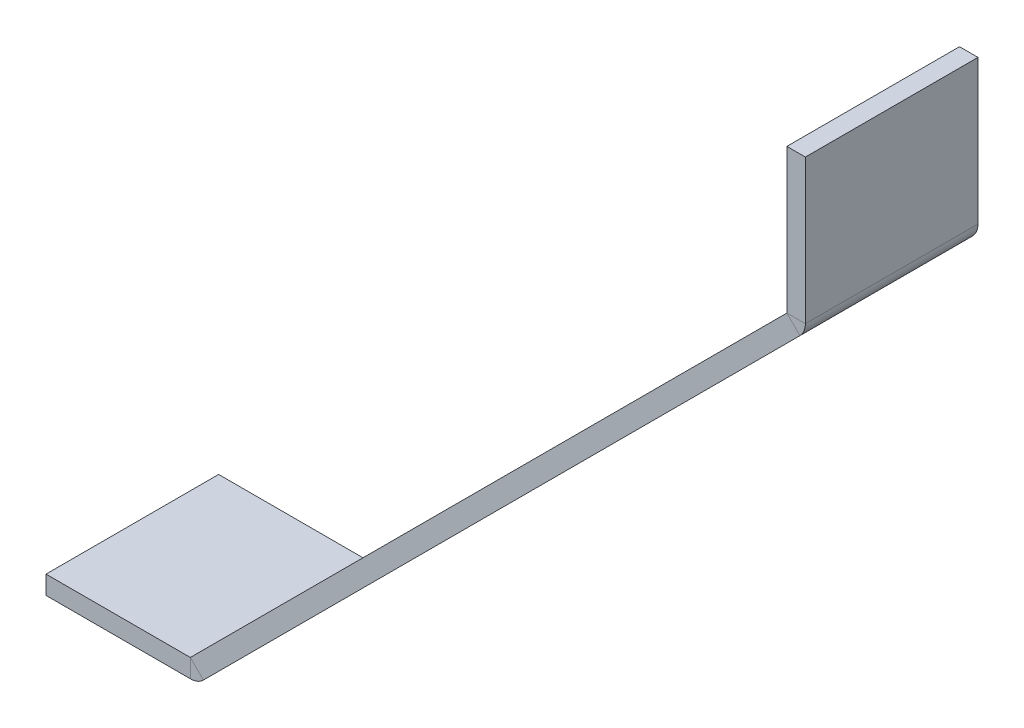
ISO-10303-21;
HEADER;
FILE_DESCRIPTION(('STEP AP214'),'2;1');
FILE_NAME('part.step','',(''),(''),'','','');
FILE_SCHEMA(('AUTOMOTIVE_DESIGN { 1 0 10303 214 1 1 1 1 }'));
ENDSEC;
DATA;
#1=APPLICATION_CONTEXT('core data for automotive mechanical design processes');
#2=APPLICATION_PROTOCOL_DEFINITION('international standard','automotive_design',2000,#1);
#3=PRODUCT_CONTEXT('',#1,'mechanical');
#4=PRODUCT('Part','Part','',(#3));
#5=PRODUCT_RELATED_PRODUCT_CATEGORY('part','',(#4));
#6=PRODUCT_DEFINITION_FORMATION('','',#4);
#7=PRODUCT_DEFINITION_CONTEXT('part definition',#1,'design');
#8=PRODUCT_DEFINITION('design','',#6,#7);
#9=PRODUCT_DEFINITION_SHAPE('','',#8);
#10=(LENGTH_UNIT() NAMED_UNIT(*) SI_UNIT(.MILLI.,.METRE.));
#11=(NAMED_UNIT(*) PLANE_ANGLE_UNIT() SI_UNIT($,.RADIAN.));
#12=(NAMED_UNIT(*) SI_UNIT($,.STERADIAN.) SOLID_ANGLE_UNIT());
#13=UNCERTAINTY_MEASURE_WITH_UNIT(LENGTH_MEASURE(1.E-05),#10,'distance_accuracy_value','');
#14=(GEOMETRIC_REPRESENTATION_CONTEXT(3) GLOBAL_UNCERTAINTY_ASSIGNED_CONTEXT((#13)) GLOBAL_UNIT_ASSIGNED_CONTEXT((#10,
#11,#12)) REPRESENTATION_CONTEXT('',''));
#15=CARTESIAN_POINT('',(0.,0.,0.));
#16=DIRECTION('',(0.,0.,1.));
#17=DIRECTION('',(1.,0.,0.));
#18=AXIS2_PLACEMENT_3D('',#15,#16,#17);
#19=CARTESIAN_POINT('',(4.07259434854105,-8.25420168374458,0.));
#20=DIRECTION('',(0.707106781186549,-0.707106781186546,0.));
#21=DIRECTION('',(0.,0.,-1.));
#22=AXIS2_PLACEMENT_3D('',#19,#20,#21);
#23=PLANE('',#22);
#24=CARTESIAN_POINT('',(28.1142249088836,15.7874288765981,-7.));
#25=DIRECTION('',(0.707106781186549,-0.707106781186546,0.));
#26=DIRECTION('',(0.,0.,-1.));
#27=AXIS2_PLACEMENT_3D('',#24,#25,#26);
#28=CIRCLE('',#27,3.15);
#29=CARTESIAN_POINT('',(28.1142249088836,15.7874288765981,-10.15));
#30=VERTEX_POINT('',#29);
#31=EDGE_CURVE('E168',#30,#30,#28,.T.);
#32=ORIENTED_EDGE('',*,*,#31,.F.);
#33=EDGE_LOOP('',(#32));
#34=FACE_BOUND('',#33,.T.);
#35=CARTESIAN_POINT('',(45.7918944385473,33.4650984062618,-7.));
#36=DIRECTION('',(0.707106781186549,-0.707106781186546,0.));
#37=DIRECTION('',(0.,0.,-1.));
#38=AXIS2_PLACEMENT_3D('',#35,#36,#37);
#39=CIRCLE('',#38,3.15);
#40=CARTESIAN_POINT('',(45.7918944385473,33.4650984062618,-10.15));
#41=VERTEX_POINT('',#40);
#42=EDGE_CURVE('E203',#41,#41,#39,.T.);
#43=ORIENTED_EDGE('',*,*,#42,.F.);
#44=EDGE_LOOP('',(#43));
#45=FACE_BOUND('',#44,.T.);
#46=DIRECTION('',(-0.707106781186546,-0.707106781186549,0.));
#47=VECTOR('',#46,1.);
#48=CARTESIAN_POINT('',(4.07259434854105,-8.25420168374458,-14.));
#49=LINE('',#48,#47);
#50=CARTESIAN_POINT('',(61.1399834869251,48.8131874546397,-14.));
#51=VERTEX_POINT('',#50);
#52=CARTESIAN_POINT('',(12.7661358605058,0.439339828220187,-14.));
#53=VERTEX_POINT('',#52);
#54=EDGE_CURVE('E57',#51,#53,#49,.T.);
#55=ORIENTED_EDGE('',*,*,#54,.F.);
#56=DIRECTION('',(0.,0.,1.));
#57=VECTOR('',#56,1.);
#58=CARTESIAN_POINT('',(61.1399834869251,48.8131874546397,0.));
#59=LINE('',#58,#57);
#60=CARTESIAN_POINT('',(61.1399834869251,48.8131874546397,0.));
#61=VERTEX_POINT('',#60);
#62=EDGE_CURVE('E49',#51,#61,#59,.T.);
#63=ORIENTED_EDGE('',*,*,#62,.T.);
#64=DIRECTION('',(0.707106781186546,0.707106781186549,0.));
#65=VECTOR('',#64,1.);
#66=CARTESIAN_POINT('',(4.07259434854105,-8.25420168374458,0.));
#67=LINE('',#66,#65);
#68=CARTESIAN_POINT('',(12.7661358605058,0.43933982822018,0.));
#69=VERTEX_POINT('',#68);
#70=EDGE_CURVE('E65',#69,#61,#67,.T.);
#71=ORIENTED_EDGE('',*,*,#70,.F.);
#72=DIRECTION('',(0.,0.,1.));
#73=VECTOR('',#72,1.);
#74=CARTESIAN_POINT('',(12.7661358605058,0.439339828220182,0.));
#75=LINE('',#74,#73);
#76=EDGE_CURVE('E218',#53,#69,#75,.T.);
#77=ORIENTED_EDGE('',*,*,#76,.F.);
#78=EDGE_LOOP('',(#55,#63,#71,#77));
#79=FACE_BOUND('',#78,.T.);
#80=ADVANCED_FACE('F40',(#34,#45,#79),#23,.T.);
#81=CARTESIAN_POINT('',(3.01193417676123,-7.19354151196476,-14.));
#82=DIRECTION('',(0.,0.,1.));
#83=DIRECTION('',(0.707106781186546,0.707106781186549,0.));
#84=AXIS2_PLACEMENT_3D('',#81,#82,#83);
#85=PLANE('',#84);
#86=DIRECTION('',(-0.707106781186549,0.707106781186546,0.));
#87=VECTOR('',#86,1.);
#88=CARTESIAN_POINT('',(60.0793233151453,49.8738476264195,-14.));
#89=LINE('',#88,#87);
#90=CARTESIAN_POINT('',(60.0793233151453,49.8738476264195,-14.));
#91=VERTEX_POINT('',#90);
#92=EDGE_CURVE('E12',#51,#91,#89,.T.);
#93=ORIENTED_EDGE('',*,*,#92,.F.);
#94=ORIENTED_EDGE('',*,*,#54,.T.);
#95=DIRECTION('',(-0.707106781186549,0.707106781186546,0.));
#96=VECTOR('',#95,1.);
#97=CARTESIAN_POINT('',(11.705475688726,1.5,-14.));
#98=LINE('',#97,#96);
#99=CARTESIAN_POINT('',(11.705475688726,1.5,-14.));
#100=VERTEX_POINT('',#99);
#101=EDGE_CURVE('E215',#53,#100,#98,.T.);
#102=ORIENTED_EDGE('',*,*,#101,.T.);
#103=DIRECTION('',(-0.707106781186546,-0.707106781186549,0.));
#104=VECTOR('',#103,1.);
#105=CARTESIAN_POINT('',(3.01193417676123,-7.19354151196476,-14.));
#106=LINE('',#105,#104);
#107=EDGE_CURVE('E44',#91,#100,#106,.T.);
#108=ORIENTED_EDGE('',*,*,#107,.F.);
#109=EDGE_LOOP('',(#93,#94,#102,#108));
#110=FACE_BOUND('',#109,.T.);
#111=ADVANCED_FACE('F42',(#110),#85,.F.);
#112=CARTESIAN_POINT('',(3.01193417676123,-7.19354151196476,0.));
#113=DIRECTION('',(0.,0.,-1.));
#114=DIRECTION('',(-0.707106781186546,-0.707106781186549,0.));
#115=AXIS2_PLACEMENT_3D('',#112,#113,#114);
#116=PLANE('',#115);
#117=DIRECTION('',(0.707106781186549,-0.707106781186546,0.));
#118=VECTOR('',#117,1.);
#119=CARTESIAN_POINT('',(60.0793233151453,49.8738476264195,0.));
#120=LINE('',#119,#118);
#121=CARTESIAN_POINT('',(60.0793233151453,49.8738476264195,0.));
#122=VERTEX_POINT('',#121);
#123=EDGE_CURVE('E225',#122,#61,#120,.T.);
#124=ORIENTED_EDGE('',*,*,#123,.F.);
#125=DIRECTION('',(0.707106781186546,0.707106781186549,0.));
#126=VECTOR('',#125,1.);
#127=CARTESIAN_POINT('',(3.01193417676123,-7.19354151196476,0.));
#128=LINE('',#127,#126);
#129=CARTESIAN_POINT('',(11.705475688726,1.5,0.));
#130=VERTEX_POINT('',#129);
#131=EDGE_CURVE('E230',#130,#122,#128,.T.);
#132=ORIENTED_EDGE('',*,*,#131,.F.);
#133=DIRECTION('',(0.707106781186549,-0.707106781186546,0.));
#134=VECTOR('',#133,1.);
#135=CARTESIAN_POINT('',(11.705475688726,1.5,0.));
#136=LINE('',#135,#134);
#137=EDGE_CURVE('E220',#130,#69,#136,.T.);
#138=ORIENTED_EDGE('',*,*,#137,.T.);
#139=ORIENTED_EDGE('',*,*,#70,.T.);
#140=EDGE_LOOP('',(#124,#132,#138,#139));
#141=FACE_BOUND('',#140,.T.);
#142=ADVANCED_FACE('F258',(#141),#116,.F.);
#143=CARTESIAN_POINT('',(3.01193417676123,-7.19354151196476,0.));
#144=DIRECTION('',(0.707106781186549,-0.707106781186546,0.));
#145=DIRECTION('',(0.,0.,-1.));
#146=AXIS2_PLACEMENT_3D('',#143,#144,#145);
#147=PLANE('',#146);
#148=DIRECTION('',(0.,0.,1.));
#149=VECTOR('',#148,1.);
#150=CARTESIAN_POINT('',(60.0793233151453,49.8738476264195,0.));
#151=LINE('',#150,#149);
#152=EDGE_CURVE('E222',#91,#122,#151,.T.);
#153=ORIENTED_EDGE('',*,*,#152,.F.);
#154=ORIENTED_EDGE('',*,*,#107,.T.);
#155=DIRECTION('',(0.,0.,1.));
#156=VECTOR('',#155,1.);
#157=CARTESIAN_POINT('',(11.705475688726,1.5,0.));
#158=LINE('',#157,#156);
#159=EDGE_CURVE('E165',#100,#130,#158,.T.);
#160=ORIENTED_EDGE('',*,*,#159,.T.);
#161=ORIENTED_EDGE('',*,*,#131,.T.);
#162=EDGE_LOOP('',(#153,#154,#160,#161));
#163=FACE_BOUND('',#162,.T.);
#164=CARTESIAN_POINT('',(27.0535647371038,16.8480890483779,-7.));
#165=DIRECTION('',(-0.707106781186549,0.707106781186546,0.));
#166=DIRECTION('',(0.,0.,1.));
#167=AXIS2_PLACEMENT_3D('',#164,#165,#166);
#168=CIRCLE('',#167,1.75);
#169=CARTESIAN_POINT('',(27.0535647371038,16.8480890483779,-5.24999999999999));
#170=VERTEX_POINT('',#169);
#171=EDGE_CURVE('E209',#170,#170,#168,.T.);
#172=ORIENTED_EDGE('',*,*,#171,.F.);
#173=EDGE_LOOP('',(#172));
#174=FACE_BOUND('',#173,.T.);
#175=CARTESIAN_POINT('',(44.7312342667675,34.5257585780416,-7.));
#176=DIRECTION('',(-0.707106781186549,0.707106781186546,0.));
#177=DIRECTION('',(0.,0.,1.));
#178=AXIS2_PLACEMENT_3D('',#175,#176,#177);
#179=CIRCLE('',#178,1.75);
#180=CARTESIAN_POINT('',(44.7312342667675,34.5257585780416,-5.25));
#181=VERTEX_POINT('',#180);
#182=EDGE_CURVE('E212',#181,#181,#179,.T.);
#183=ORIENTED_EDGE('',*,*,#182,.F.);
#184=EDGE_LOOP('',(#183));
#185=FACE_BOUND('',#184,.T.);
#186=ADVANCED_FACE('F235',(#163,#174,#185),#147,.F.);
#187=CARTESIAN_POINT('',(44.7312342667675,34.5257585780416,-7.));
#188=DIRECTION('',(0.707106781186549,-0.707106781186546,0.));
#189=DIRECTION('',(0.,0.,-1.));
#190=AXIS2_PLACEMENT_3D('',#187,#188,#189);
#191=CYLINDRICAL_SURFACE('',#190,1.75);
#192=CARTESIAN_POINT('',(44.8019449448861,34.455047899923,-7.));
#193=DIRECTION('',(0.707106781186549,-0.707106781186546,0.));
#194=DIRECTION('',(0.,0.,-1.));
#195=AXIS2_PLACEMENT_3D('',#192,#193,#194);
#196=CIRCLE('',#195,1.75);
#197=CARTESIAN_POINT('',(44.8019449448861,34.455047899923,-8.75));
#198=VERTEX_POINT('',#197);
#199=EDGE_CURVE('E206',#198,#198,#196,.T.);
#200=ORIENTED_EDGE('',*,*,#199,.T.);
#201=EDGE_LOOP('',(#200));
#202=FACE_BOUND('',#201,.T.);
#203=ORIENTED_EDGE('',*,*,#182,.T.);
#204=EDGE_LOOP('',(#203));
#205=FACE_BOUND('',#204,.T.);
#206=ADVANCED_FACE('F314',(#202,#205),#191,.F.);
#207=CARTESIAN_POINT('',(27.0535647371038,16.8480890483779,-7.));
#208=DIRECTION('',(0.707106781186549,-0.707106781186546,0.));
#209=DIRECTION('',(0.,0.,-1.));
#210=AXIS2_PLACEMENT_3D('',#207,#208,#209);
#211=CYLINDRICAL_SURFACE('',#210,1.75);
#212=CARTESIAN_POINT('',(27.1242754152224,16.7773783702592,-7.));
#213=DIRECTION('',(0.707106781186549,-0.707106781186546,0.));
#214=DIRECTION('',(0.,0.,-1.));
#215=AXIS2_PLACEMENT_3D('',#212,#213,#214);
#216=CIRCLE('',#215,1.75);
#217=CARTESIAN_POINT('',(27.1242754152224,16.7773783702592,-8.75));
#218=VERTEX_POINT('',#217);
#219=EDGE_CURVE('E200',#218,#218,#216,.T.);
#220=ORIENTED_EDGE('',*,*,#219,.T.);
#221=EDGE_LOOP('',(#220));
#222=FACE_BOUND('',#221,.T.);
#223=ORIENTED_EDGE('',*,*,#171,.T.);
#224=EDGE_LOOP('',(#223));
#225=FACE_BOUND('',#224,.T.);
#226=ADVANCED_FACE('F317',(#222,#225),#211,.F.);
#227=CARTESIAN_POINT('',(45.7918944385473,33.4650984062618,-7.));
#228=DIRECTION('',(0.707106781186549,-0.707106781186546,0.));
#229=DIRECTION('',(0.,0.,-1.));
#230=AXIS2_PLACEMENT_3D('',#227,#228,#229);
#231=CONICAL_SURFACE('',#230,3.15,0.785398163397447);
#232=ORIENTED_EDGE('',*,*,#199,.F.);
#233=EDGE_LOOP('',(#232));
#234=FACE_BOUND('',#233,.T.);
#235=ORIENTED_EDGE('',*,*,#42,.T.);
#236=EDGE_LOOP('',(#235));
#237=FACE_BOUND('',#236,.T.);
#238=ADVANCED_FACE('F298',(#234,#237),#231,.F.);
#239=CARTESIAN_POINT('',(28.1142249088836,15.7874288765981,-7.));
#240=DIRECTION('',(0.707106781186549,-0.707106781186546,0.));
#241=DIRECTION('',(0.,0.,-1.));
#242=AXIS2_PLACEMENT_3D('',#239,#240,#241);
#243=CONICAL_SURFACE('',#242,3.15,0.785398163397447);
#244=ORIENTED_EDGE('',*,*,#219,.F.);
#245=EDGE_LOOP('',(#244));
#246=FACE_BOUND('',#245,.T.);
#247=ORIENTED_EDGE('',*,*,#31,.T.);
#248=EDGE_LOOP('',(#247));
#249=FACE_BOUND('',#248,.T.);
#250=ADVANCED_FACE('F291',(#246,#249),#243,.F.);
#251=CARTESIAN_POINT('',(0.,1.5,0.));
#252=DIRECTION('',(1.,0.,0.));
#253=DIRECTION('',(0.,0.,-1.));
#254=AXIS2_PLACEMENT_3D('',#251,#252,#253);
#255=PLANE('',#254);
#256=DIRECTION('',(0.,0.,1.));
#257=VECTOR('',#256,1.);
#258=CARTESIAN_POINT('',(0.,0.,0.));
#259=LINE('',#258,#257);
#260=CARTESIAN_POINT('',(0.,0.,-14.));
#261=VERTEX_POINT('',#260);
#262=CARTESIAN_POINT('',(0.,0.,0.));
#263=VERTEX_POINT('',#262);
#264=EDGE_CURVE('E187',#261,#263,#259,.T.);
#265=ORIENTED_EDGE('',*,*,#264,.T.);
#266=DIRECTION('',(0.,-1.,0.));
#267=VECTOR('',#266,1.);
#268=CARTESIAN_POINT('',(0.,1.5,0.));
#269=LINE('',#268,#267);
#270=CARTESIAN_POINT('',(0.,1.5,0.));
#271=VERTEX_POINT('',#270);
#272=EDGE_CURVE('E169',#271,#263,#269,.T.);
#273=ORIENTED_EDGE('',*,*,#272,.F.);
#274=DIRECTION('',(0.,0.,1.));
#275=VECTOR('',#274,1.);
#276=CARTESIAN_POINT('',(0.,1.5,0.));
#277=LINE('',#276,#275);
#278=CARTESIAN_POINT('',(0.,1.5,-14.));
#279=VERTEX_POINT('',#278);
#280=EDGE_CURVE('E179',#279,#271,#277,.T.);
#281=ORIENTED_EDGE('',*,*,#280,.F.);
#282=DIRECTION('',(0.,-1.,0.));
#283=VECTOR('',#282,1.);
#284=CARTESIAN_POINT('',(0.,1.5,-14.));
#285=LINE('',#284,#283);
#286=EDGE_CURVE('E184',#279,#261,#285,.T.);
#287=ORIENTED_EDGE('',*,*,#286,.T.);
#288=EDGE_LOOP('',(#265,#273,#281,#287));
#289=FACE_BOUND('',#288,.T.);
#290=ADVANCED_FACE('F289',(#289),#255,.F.);
#291=CARTESIAN_POINT('',(0.,1.5,0.));
#292=DIRECTION('',(0.,-1.,0.));
#293=DIRECTION('',(0.,0.,-1.));
#294=AXIS2_PLACEMENT_3D('',#291,#292,#293);
#295=PLANE('',#294);
#296=ORIENTED_EDGE('',*,*,#159,.F.);
#297=DIRECTION('',(-1.,0.,0.));
#298=VECTOR('',#297,1.);
#299=CARTESIAN_POINT('',(0.,1.5,-14.));
#300=LINE('',#299,#298);
#301=EDGE_CURVE('E182',#100,#279,#300,.T.);
#302=ORIENTED_EDGE('',*,*,#301,.T.);
#303=ORIENTED_EDGE('',*,*,#280,.T.);
#304=DIRECTION('',(1.,0.,0.));
#305=VECTOR('',#304,1.);
#306=CARTESIAN_POINT('',(0.,1.5,0.));
#307=LINE('',#306,#305);
#308=EDGE_CURVE('E177',#271,#130,#307,.T.);
#309=ORIENTED_EDGE('',*,*,#308,.T.);
#310=EDGE_LOOP('',(#296,#302,#303,#309));
#311=FACE_BOUND('',#310,.T.);
#312=ADVANCED_FACE('F249',(#311),#295,.F.);
#313=CARTESIAN_POINT('',(0.,1.5,-14.));
#314=DIRECTION('',(0.,0.,1.));
#315=DIRECTION('',(1.,0.,0.));
#316=AXIS2_PLACEMENT_3D('',#313,#314,#315);
#317=PLANE('',#316);
#318=DIRECTION('',(0.,1.,0.));
#319=VECTOR('',#318,1.);
#320=CARTESIAN_POINT('',(11.705475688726,1.5,-14.));
#321=LINE('',#320,#319);
#322=CARTESIAN_POINT('',(11.705475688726,0.,-14.));
#323=VERTEX_POINT('',#322);
#324=EDGE_CURVE('E190',#323,#100,#321,.T.);
#325=ORIENTED_EDGE('',*,*,#324,.F.);
#326=DIRECTION('',(-1.,0.,0.));
#327=VECTOR('',#326,1.);
#328=CARTESIAN_POINT('',(0.,0.,-14.));
#329=LINE('',#328,#327);
#330=EDGE_CURVE('E175',#323,#261,#329,.T.);
#331=ORIENTED_EDGE('',*,*,#330,.T.);
#332=ORIENTED_EDGE('',*,*,#286,.F.);
#333=ORIENTED_EDGE('',*,*,#301,.F.);
#334=EDGE_LOOP('',(#325,#331,#332,#333));
#335=FACE_BOUND('',#334,.T.);
#336=ADVANCED_FACE('F245',(#335),#317,.F.);
#337=CARTESIAN_POINT('',(0.,0.,0.));
#338=DIRECTION('',(0.,-1.,0.));
#339=DIRECTION('',(0.,0.,-1.));
#340=AXIS2_PLACEMENT_3D('',#337,#338,#339);
#341=PLANE('',#340);
#342=ORIENTED_EDGE('',*,*,#330,.F.);
#343=DIRECTION('',(0.,0.,1.));
#344=VECTOR('',#343,1.);
#345=CARTESIAN_POINT('',(11.705475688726,0.,0.));
#346=LINE('',#345,#344);
#347=CARTESIAN_POINT('',(11.705475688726,0.,0.));
#348=VERTEX_POINT('',#347);
#349=EDGE_CURVE('E172',#323,#348,#346,.T.);
#350=ORIENTED_EDGE('',*,*,#349,.T.);
#351=DIRECTION('',(1.,0.,0.));
#352=VECTOR('',#351,1.);
#353=CARTESIAN_POINT('',(0.,0.,0.));
#354=LINE('',#353,#352);
#355=EDGE_CURVE('E166',#263,#348,#354,.T.);
#356=ORIENTED_EDGE('',*,*,#355,.F.);
#357=ORIENTED_EDGE('',*,*,#264,.F.);
#358=EDGE_LOOP('',(#342,#350,#356,#357));
#359=FACE_BOUND('',#358,.T.);
#360=ADVANCED_FACE('F286',(#359),#341,.T.);
#361=CARTESIAN_POINT('',(0.,1.5,0.));
#362=DIRECTION('',(0.,0.,-1.));
#363=DIRECTION('',(-1.,0.,0.));
#364=AXIS2_PLACEMENT_3D('',#361,#362,#363);
#365=PLANE('',#364);
#366=DIRECTION('',(0.,-1.,0.));
#367=VECTOR('',#366,1.);
#368=CARTESIAN_POINT('',(11.705475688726,1.5,0.));
#369=LINE('',#368,#367);
#370=EDGE_CURVE('E193',#130,#348,#369,.T.);
#371=ORIENTED_EDGE('',*,*,#370,.F.);
#372=ORIENTED_EDGE('',*,*,#308,.F.);
#373=ORIENTED_EDGE('',*,*,#272,.T.);
#374=ORIENTED_EDGE('',*,*,#355,.T.);
#375=EDGE_LOOP('',(#371,#372,#373,#374));
#376=FACE_BOUND('',#375,.T.);
#377=ADVANCED_FACE('F254',(#376),#365,.F.);
#378=CARTESIAN_POINT('',(11.705475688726,1.5,0.));
#379=DIRECTION('',(0.,0.,-1.));
#380=DIRECTION('',(-1.,0.,0.));
#381=AXIS2_PLACEMENT_3D('',#378,#379,#380);
#382=PLANE('',#381);
#383=CARTESIAN_POINT('',(11.705475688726,1.5,0.));
#384=DIRECTION('',(0.,0.,-1.));
#385=DIRECTION('',(-1.,0.,0.));
#386=AXIS2_PLACEMENT_3D('',#383,#384,#385);
#387=CIRCLE('',#386,1.5);
#388=EDGE_CURVE('E162',#69,#348,#387,.T.);
#389=ORIENTED_EDGE('',*,*,#388,.F.);
#390=ORIENTED_EDGE('',*,*,#137,.F.);
#391=ORIENTED_EDGE('',*,*,#370,.T.);
#392=EDGE_LOOP('',(#389,#390,#391));
#393=FACE_BOUND('',#392,.T.);
#394=ADVANCED_FACE('F257',(#393),#382,.F.);
#395=CARTESIAN_POINT('',(11.705475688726,1.5,-14.));
#396=DIRECTION('',(0.,0.,-1.));
#397=DIRECTION('',(-1.,0.,0.));
#398=AXIS2_PLACEMENT_3D('',#395,#396,#397);
#399=CYLINDRICAL_SURFACE('',#398,1.5);
#400=CARTESIAN_POINT('',(11.705475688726,1.5,-14.));
#401=DIRECTION('',(0.,0.,-1.));
#402=DIRECTION('',(-1.,0.,0.));
#403=AXIS2_PLACEMENT_3D('',#400,#401,#402);
#404=CIRCLE('',#403,1.5);
#405=EDGE_CURVE('E159',#53,#323,#404,.T.);
#406=ORIENTED_EDGE('',*,*,#405,.F.);
#407=ORIENTED_EDGE('',*,*,#76,.T.);
#408=ORIENTED_EDGE('',*,*,#388,.T.);
#409=ORIENTED_EDGE('',*,*,#349,.F.);
#410=EDGE_LOOP('',(#406,#407,#408,#409));
#411=FACE_BOUND('',#410,.T.);
#412=ADVANCED_FACE('F284',(#411),#399,.T.);
#413=CARTESIAN_POINT('',(11.705475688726,1.5,-14.));
#414=DIRECTION('',(0.,0.,1.));
#415=DIRECTION('',(1.,0.,0.));
#416=AXIS2_PLACEMENT_3D('',#413,#414,#415);
#417=PLANE('',#416);
#418=ORIENTED_EDGE('',*,*,#101,.F.);
#419=ORIENTED_EDGE('',*,*,#405,.T.);
#420=ORIENTED_EDGE('',*,*,#324,.T.);
#421=EDGE_LOOP('',(#418,#419,#420));
#422=FACE_BOUND('',#421,.T.);
#423=ADVANCED_FACE('F241',(#422),#417,.F.);
#424=CARTESIAN_POINT('',(60.0793233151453,49.8738476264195,0.));
#425=DIRECTION('',(0.,0.,-1.));
#426=DIRECTION('',(-1.,0.,0.));
#427=AXIS2_PLACEMENT_3D('',#424,#425,#426);
#428=PLANE('',#427);
#429=CARTESIAN_POINT('',(60.0793233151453,49.8738476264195,0.));
#430=DIRECTION('',(0.,0.,-1.));
#431=DIRECTION('',(-1.,0.,0.));
#432=AXIS2_PLACEMENT_3D('',#429,#430,#431);
#433=CIRCLE('',#432,1.49999999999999);
#434=CARTESIAN_POINT('',(61.5793233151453,49.8738476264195,0.));
#435=VERTEX_POINT('',#434);
#436=EDGE_CURVE('E155',#435,#61,#433,.T.);
#437=ORIENTED_EDGE('',*,*,#436,.F.);
#438=DIRECTION('',(1.,0.,0.));
#439=VECTOR('',#438,1.);
#440=CARTESIAN_POINT('',(60.0793233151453,49.8738476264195,0.));
#441=LINE('',#440,#439);
#442=EDGE_CURVE('E130',#122,#435,#441,.T.);
#443=ORIENTED_EDGE('',*,*,#442,.F.);
#444=ORIENTED_EDGE('',*,*,#123,.T.);
#445=EDGE_LOOP('',(#437,#443,#444));
#446=FACE_BOUND('',#445,.T.);
#447=ADVANCED_FACE('F261',(#446),#428,.F.);
#448=CARTESIAN_POINT('',(60.0793233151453,49.8738476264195,-14.));
#449=DIRECTION('',(0.,0.,-1.));
#450=DIRECTION('',(-1.,0.,0.));
#451=AXIS2_PLACEMENT_3D('',#448,#449,#450);
#452=CYLINDRICAL_SURFACE('',#451,1.49999999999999);
#453=CARTESIAN_POINT('',(60.0793233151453,49.8738476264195,-14.));
#454=DIRECTION('',(0.,0.,-1.));
#455=DIRECTION('',(-1.,0.,0.));
#456=AXIS2_PLACEMENT_3D('',#453,#454,#455);
#457=CIRCLE('',#456,1.49999999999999);
#458=CARTESIAN_POINT('',(61.5793233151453,49.8738476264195,-14.));
#459=VERTEX_POINT('',#458);
#460=EDGE_CURVE('E152',#459,#51,#457,.T.);
#461=ORIENTED_EDGE('',*,*,#460,.F.);
#462=DIRECTION('',(0.,0.,1.));
#463=VECTOR('',#462,1.);
#464=CARTESIAN_POINT('',(61.5793233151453,49.8738476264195,0.));
#465=LINE('',#464,#463);
#466=EDGE_CURVE('E147',#459,#435,#465,.T.);
#467=ORIENTED_EDGE('',*,*,#466,.T.);
#468=ORIENTED_EDGE('',*,*,#436,.T.);
#469=ORIENTED_EDGE('',*,*,#62,.F.);
#470=EDGE_LOOP('',(#461,#467,#468,#469));
#471=FACE_BOUND('',#470,.T.);
#472=ADVANCED_FACE('F282',(#471),#452,.T.);
#473=CARTESIAN_POINT('',(60.0793233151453,49.8738476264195,-14.));
#474=DIRECTION('',(0.,0.,1.));
#475=DIRECTION('',(1.,0.,0.));
#476=AXIS2_PLACEMENT_3D('',#473,#474,#475);
#477=PLANE('',#476);
#478=DIRECTION('',(-1.,0.,0.));
#479=VECTOR('',#478,1.);
#480=CARTESIAN_POINT('',(60.0793233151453,49.8738476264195,-14.));
#481=LINE('',#480,#479);
#482=EDGE_CURVE('E273',#459,#91,#481,.T.);
#483=ORIENTED_EDGE('',*,*,#482,.F.);
#484=ORIENTED_EDGE('',*,*,#460,.T.);
#485=ORIENTED_EDGE('',*,*,#92,.T.);
#486=EDGE_LOOP('',(#483,#484,#485));
#487=FACE_BOUND('',#486,.T.);
#488=ADVANCED_FACE('F279',(#487),#477,.F.);
#489=CARTESIAN_POINT('',(60.0793233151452,61.5793233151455,0.));
#490=DIRECTION('',(0.,-1.,0.));
#491=DIRECTION('',(0.,0.,1.));
#492=AXIS2_PLACEMENT_3D('',#489,#490,#491);
#493=PLANE('',#492);
#494=DIRECTION('',(0.,0.,-1.));
#495=VECTOR('',#494,1.);
#496=CARTESIAN_POINT('',(61.5793233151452,61.5793233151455,0.));
#497=LINE('',#496,#495);
#498=CARTESIAN_POINT('',(61.5793233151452,61.5793233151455,0.));
#499=VERTEX_POINT('',#498);
#500=CARTESIAN_POINT('',(61.5793233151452,61.5793233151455,-14.));
#501=VERTEX_POINT('',#500);
#502=EDGE_CURVE('E139',#499,#501,#497,.T.);
#503=ORIENTED_EDGE('',*,*,#502,.T.);
#504=DIRECTION('',(1.,0.,0.));
#505=VECTOR('',#504,1.);
#506=CARTESIAN_POINT('',(60.0793233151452,61.5793233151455,-14.));
#507=LINE('',#506,#505);
#508=CARTESIAN_POINT('',(60.0793233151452,61.5793233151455,-14.));
#509=VERTEX_POINT('',#508);
#510=EDGE_CURVE('E156',#509,#501,#507,.T.);
#511=ORIENTED_EDGE('',*,*,#510,.F.);
#512=DIRECTION('',(0.,0.,-1.));
#513=VECTOR('',#512,1.);
#514=CARTESIAN_POINT('',(60.0793233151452,61.5793233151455,0.));
#515=LINE('',#514,#513);
#516=CARTESIAN_POINT('',(60.0793233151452,61.5793233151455,0.));
#517=VERTEX_POINT('',#516);
#518=EDGE_CURVE('E141',#517,#509,#515,.T.);
#519=ORIENTED_EDGE('',*,*,#518,.F.);
#520=DIRECTION('',(1.,0.,0.));
#521=VECTOR('',#520,1.);
#522=CARTESIAN_POINT('',(60.0793233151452,61.5793233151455,0.));
#523=LINE('',#522,#521);
#524=EDGE_CURVE('E127',#517,#499,#523,.T.);
#525=ORIENTED_EDGE('',*,*,#524,.T.);
#526=EDGE_LOOP('',(#503,#511,#519,#525));
#527=FACE_BOUND('',#526,.T.);
#528=ADVANCED_FACE('F137',(#527),#493,.F.);
#529=CARTESIAN_POINT('',(60.0793233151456,-31.4206766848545,0.));
#530=DIRECTION('',(1.,0.,0.));
#531=DIRECTION('',(0.,0.,-1.));
#532=AXIS2_PLACEMENT_3D('',#529,#530,#531);
#533=PLANE('',#532);
#534=DIRECTION('',(0.,-1.,0.));
#535=VECTOR('',#534,1.);
#536=CARTESIAN_POINT('',(60.0793233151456,-31.4206766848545,-14.));
#537=LINE('',#536,#535);
#538=EDGE_CURVE('E142',#509,#91,#537,.T.);
#539=ORIENTED_EDGE('',*,*,#538,.T.);
#540=ORIENTED_EDGE('',*,*,#152,.T.);
#541=DIRECTION('',(0.,1.,0.));
#542=VECTOR('',#541,1.);
#543=CARTESIAN_POINT('',(60.0793233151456,-31.4206766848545,0.));
#544=LINE('',#543,#542);
#545=EDGE_CURVE('E266',#122,#517,#544,.T.);
#546=ORIENTED_EDGE('',*,*,#545,.T.);
#547=ORIENTED_EDGE('',*,*,#518,.T.);
#548=EDGE_LOOP('',(#539,#540,#546,#547));
#549=FACE_BOUND('',#548,.T.);
#550=ADVANCED_FACE('F265',(#549),#533,.F.);
#551=CARTESIAN_POINT('',(60.0793233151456,-31.4206766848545,0.));
#552=DIRECTION('',(0.,0.,-1.));
#553=DIRECTION('',(0.,-1.,0.));
#554=AXIS2_PLACEMENT_3D('',#551,#552,#553);
#555=PLANE('',#554);
#556=ORIENTED_EDGE('',*,*,#545,.F.);
#557=ORIENTED_EDGE('',*,*,#442,.T.);
#558=DIRECTION('',(0.,1.,0.));
#559=VECTOR('',#558,1.);
#560=CARTESIAN_POINT('',(61.5793233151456,-31.4206766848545,0.));
#561=LINE('',#560,#559);
#562=EDGE_CURVE('E123',#435,#499,#561,.T.);
#563=ORIENTED_EDGE('',*,*,#562,.T.);
#564=ORIENTED_EDGE('',*,*,#524,.F.);
#565=EDGE_LOOP('',(#556,#557,#563,#564));
#566=FACE_BOUND('',#565,.T.);
#567=ADVANCED_FACE('F126',(#566),#555,.F.);
#568=CARTESIAN_POINT('',(61.5793233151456,-31.4206766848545,0.));
#569=DIRECTION('',(1.,0.,0.));
#570=DIRECTION('',(0.,0.,-1.));
#571=AXIS2_PLACEMENT_3D('',#568,#569,#570);
#572=PLANE('',#571);
#573=ORIENTED_EDGE('',*,*,#466,.F.);
#574=DIRECTION('',(0.,-1.,0.));
#575=VECTOR('',#574,1.);
#576=CARTESIAN_POINT('',(61.5793233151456,-31.4206766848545,-14.));
#577=LINE('',#576,#575);
#578=EDGE_CURVE('E134',#501,#459,#577,.T.);
#579=ORIENTED_EDGE('',*,*,#578,.F.);
#580=ORIENTED_EDGE('',*,*,#502,.F.);
#581=ORIENTED_EDGE('',*,*,#562,.F.);
#582=EDGE_LOOP('',(#573,#579,#580,#581));
#583=FACE_BOUND('',#582,.T.);
#584=ADVANCED_FACE('F145',(#583),#572,.T.);
#585=CARTESIAN_POINT('',(60.0793233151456,-31.4206766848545,-14.));
#586=DIRECTION('',(0.,0.,1.));
#587=DIRECTION('',(0.,1.,0.));
#588=AXIS2_PLACEMENT_3D('',#585,#586,#587);
#589=PLANE('',#588);
#590=ORIENTED_EDGE('',*,*,#578,.T.);
#591=ORIENTED_EDGE('',*,*,#482,.T.);
#592=ORIENTED_EDGE('',*,*,#538,.F.);
#593=ORIENTED_EDGE('',*,*,#510,.T.);
#594=EDGE_LOOP('',(#590,#591,#592,#593));
#595=FACE_BOUND('',#594,.T.);
#596=ADVANCED_FACE('F276',(#595),#589,.F.);
#597=CLOSED_SHELL('',(#80,#111,#142,#186,#206,#226,#238,#250,#290,#312,#336,#360,#377,#394,#412,
#423,#447,#472,#488,#528,#550,#567,#584,#596));
#598=MANIFOLD_SOLID_BREP('B2',#597);
#599=ADVANCED_BREP_SHAPE_REPRESENTATION('',(#18,#598),#14);
#600=SHAPE_DEFINITION_REPRESENTATION(#9,#599);
ENDSEC;
END-ISO-10303-21;
